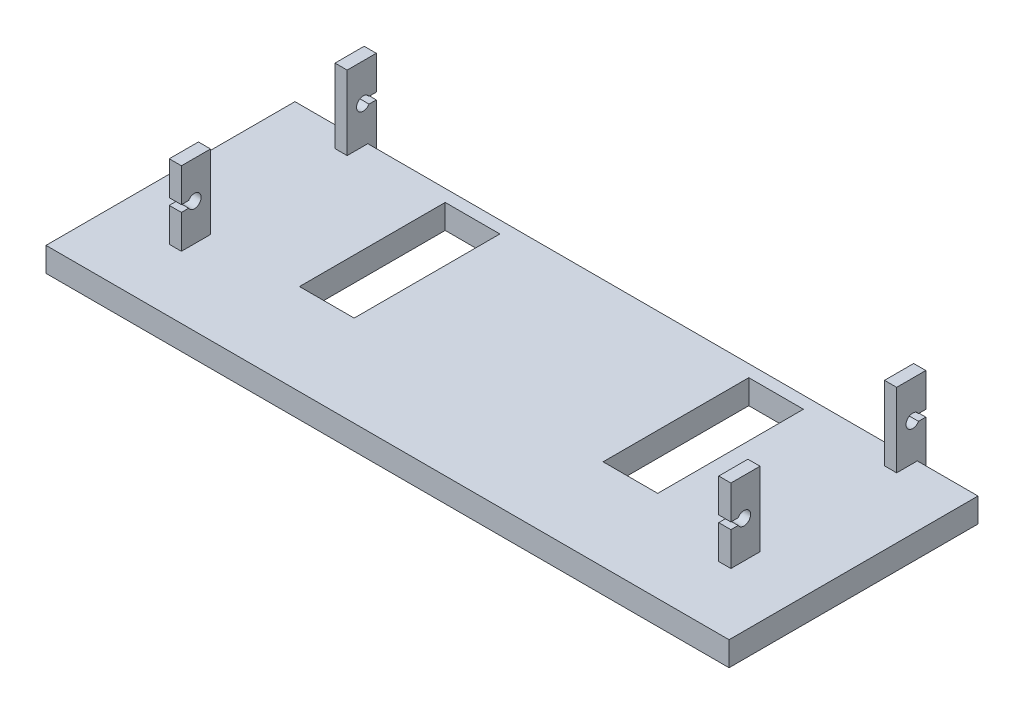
from build123d import *

# Parameters (mm, degrees)
SKETCH1_W            = 112.5
SKETCH1_H            = 41
BOSS_EXTRUDE1_DEPTH  = 4
SKETCH2_W            = 9
SKETCH2_H            = 11
CUT_EXTRUDE2_DEPTH   = 120.805049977
CUT_EXTRUDE4_DEPTH   = 9
CUT_EXTRUDE7_DEPTH   = 9
SKETCH17_W           = 2
SKETCH17_H           = 4
BOSS_EXTRUDE2_DEPTH  = 1.4
SKETCH16_W           = 2
SKETCH16_H           = 4.8
BOSS_EXTRUDE3_DEPTH  = 12.2
CUT_EXTRUDE8_DEPTH   = 100.5
SKETCH19_W           = 2
SKETCH19_H           = 4.8
BOSS_EXTRUDE4_DEPTH  = 12.2
MIRROR2_COPY_1_DEPTH = 100.5
SKETCH20_W           = 9
SKETCH20_H           = 13
CUT_EXTRUDE9_DEPTH   = 121.358173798


with BuildPart() as part:
    # Sketch1 → Boss-Extrude1 (new body)
    with BuildSketch(Plane(origin=(0, 0, 0), x_dir=(1, 0, 0), z_dir=(0, 1, 0))):
        with Locations((56.25, -20.5)):
            Rectangle(SKETCH1_W, SKETCH1_H)
    extrude(amount=BOSS_EXTRUDE1_DEPTH)

    # Sketch2 → Cut-Extrude2 (cut, through all)
    with BuildSketch(Plane(origin=(0, 0, 0), x_dir=(1, 0, 0), z_dir=(0, 1, 0))):
        with Locations((31.25, -20.5)):
            Rectangle(SKETCH2_W, SKETCH2_H)
        with Locations((81.25, -20.5)):
            Rectangle(SKETCH2_W, SKETCH2_H)
    extrude(amount=CUT_EXTRUDE2_DEPTH, mode=Mode.SUBTRACT)

    # Sketch9 → Cut-Extrude4 (cut)
    with BuildSketch(Plane(origin=(76.75, 0, 0), x_dir=(0, 0, -1), z_dir=(1, 0, 0))):
        Polygon((-37, 1.295779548), (-36.630569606, 0), (-31.431330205, 0), (-32.191604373, 2.666666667), align=None)
    extrude(amount=CUT_EXTRUDE4_DEPTH, mode=Mode.SUBTRACT)

    # Sketch14 → Cut-Extrude7 (cut)
    with BuildSketch(Plane(origin=(26.75, 0, 0), x_dir=(0, 0, -1), z_dir=(1, 0, 0))):
        Polygon((-37, 1.295779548), (-36.630569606, 0), (-31.431330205, 0), (-32.191604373, 2.666666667), align=None)
    extrude(amount=CUT_EXTRUDE7_DEPTH, mode=Mode.SUBTRACT)

    # Sketch17 → Boss-Extrude2 (add)
    with BuildSketch(Plane(origin=(0, 0, 0), x_dir=(-1, 0, 0), z_dir=(0, 0, -1))):
        with Locations((-11, 2)):
            Rectangle(SKETCH17_W, SKETCH17_H)
    boss_extrude2 = extrude(amount=BOSS_EXTRUDE2_DEPTH)

    # Sketch16 → Boss-Extrude3 (add)
    with BuildSketch(Plane(origin=(0, 4, 0), x_dir=(1, 0, 0), z_dir=(0, 1, 0))):
        with Locations((11, -1)):
            Rectangle(SKETCH16_W, SKETCH16_H)
    boss_extrude3 = extrude(amount=BOSS_EXTRUDE3_DEPTH)

    # Sketch18 → Cut-Extrude8 (cut)
    with BuildSketch(Plane.ZY):
        with BuildLine():
            ThreePointArc((1.85, 10.1), (1.03470095, 11.162518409), (-0.202627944, 10.65))
            Line((-0.202627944, 10.65), (0.75, 10.65))
            Line((0.75, 10.65), (0.75, 9.55))
            Line((0.75, 9.55), (-0.202627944, 9.55))
            ThreePointArc((-0.202627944, 9.55), (1.03470095, 9.037481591), (1.85, 10.1))
        make_face()
        with BuildLine():
            Line((0.75, 10.65), (-0.202627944, 10.65))
            ThreePointArc((-0.202627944, 10.65), (-0.35, 10.1), (-0.202627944, 9.55))
            Line((-0.202627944, 9.55), (0.75, 9.55))
            Line((0.75, 9.55), (0.75, 10.65))
        make_face()
        with BuildLine():
            ThreePointArc((1.85, 10.1), (1.03470095, 11.162518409), (-0.202627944, 10.65))
            Line((-0.202627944, 10.65), (0.75, 10.65))
            Line((0.75, 10.65), (0.75, 9.55))
            Line((0.75, 9.55), (-0.202627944, 9.55))
            ThreePointArc((-0.202627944, 9.55), (1.03470095, 9.037481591), (1.85, 10.1))
        make_face()
        with BuildLine():
            Line((0.75, 10.65), (-0.202627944, 10.65))
            ThreePointArc((-0.202627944, 10.65), (-0.35, 10.1), (-0.202627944, 9.55))
            Line((-0.202627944, 9.55), (0.75, 9.55))
            Line((0.75, 9.55), (0.75, 10.65))
        make_face()
        with BuildLine():
            Line((-0.202627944, 10.65), (-1.4, 10.65))
            Line((-1.4, 10.65), (-1.4, 9.55))
            Line((-1.4, 9.55), (-0.202627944, 9.55))
            ThreePointArc((-0.202627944, 9.55), (-0.35, 10.1), (-0.202627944, 10.65))
        make_face()
    cut_extrude8 = extrude(amount=-CUT_EXTRUDE8_DEPTH, mode=Mode.SUBTRACT)

    # Sketch19 → Boss-Extrude4 (add)
    with BuildSketch(Plane(origin=(0, 4, 0), x_dir=(1, 0, 0), z_dir=(0, 1, 0))):
        with Locations((11, -28.3)):
            Rectangle(SKETCH19_W, SKETCH19_H)
    boss_extrude4 = extrude(amount=BOSS_EXTRUDE4_DEPTH)

    # Mirror1: Cut-Extrude8 across plane
    add(cut_extrude8.mirror(Plane.XY.offset(14.65)), mode=Mode.SUBTRACT)

    # Mirror2: Boss-Extrude2, Boss-Extrude3, Cut-Extrude8, Boss-Extrude4 across plane
    add(boss_extrude2.mirror(Plane(origin=(56.25, 0, 0), x_dir=(0, 0, 1), z_dir=(1, 0, 0))))
    add(boss_extrude3.mirror(Plane(origin=(56.25, 0, 0), x_dir=(0, 0, 1), z_dir=(1, 0, 0))))
    add(cut_extrude8.mirror(Plane(origin=(56.25, 0, 0), x_dir=(0, 0, 1), z_dir=(1, 0, 0))), mode=Mode.SUBTRACT)
    add(boss_extrude4.mirror(Plane(origin=(56.25, 0, 0), x_dir=(0, 0, 1), z_dir=(1, 0, 0))))

    # Mirror2 copy 1 sketch → Mirror2 copy 1 (cut)
    with BuildSketch(Plane(origin=(112.5, 0, 29.3), x_dir=(0, 0, -1), z_dir=(1, 0, 0))):
        with BuildLine():
            ThreePointArc((1.85, 10.1), (1.03470095, 11.162518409), (-0.202627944, 10.65))
            Line((-0.202627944, 10.65), (0.75, 10.65))
            Line((0.75, 10.65), (0.75, 9.55))
            Line((0.75, 9.55), (-0.202627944, 9.55))
            ThreePointArc((-0.202627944, 9.55), (1.03470095, 9.037481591), (1.85, 10.1))
        make_face()
        with BuildLine():
            Line((0.75, 10.65), (-0.202627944, 10.65))
            ThreePointArc((-0.202627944, 10.65), (-0.35, 10.1), (-0.202627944, 9.55))
            Line((-0.202627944, 9.55), (0.75, 9.55))
            Line((0.75, 9.55), (0.75, 10.65))
        make_face()
        with BuildLine():
            ThreePointArc((1.85, 10.1), (1.03470095, 11.162518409), (-0.202627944, 10.65))
            Line((-0.202627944, 10.65), (0.75, 10.65))
            Line((0.75, 10.65), (0.75, 9.55))
            Line((0.75, 9.55), (-0.202627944, 9.55))
            ThreePointArc((-0.202627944, 9.55), (1.03470095, 9.037481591), (1.85, 10.1))
        make_face()
        with BuildLine():
            Line((0.75, 10.65), (-0.202627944, 10.65))
            ThreePointArc((-0.202627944, 10.65), (-0.35, 10.1), (-0.202627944, 9.55))
            Line((-0.202627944, 9.55), (0.75, 9.55))
            Line((0.75, 9.55), (0.75, 10.65))
        make_face()
        with BuildLine():
            Line((-0.202627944, 10.65), (-1.4, 10.65))
            Line((-1.4, 10.65), (-1.4, 9.55))
            Line((-1.4, 9.55), (-0.202627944, 9.55))
            ThreePointArc((-0.202627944, 9.55), (-0.35, 10.1), (-0.202627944, 10.65))
        make_face()
    extrude(amount=-MIRROR2_COPY_1_DEPTH, mode=Mode.SUBTRACT)

    # Sketch20 → Cut-Extrude9 (cut, through all)
    with BuildSketch(Plane(origin=(0, 4, 0), x_dir=(1, 0, 0), z_dir=(0, 1, 0))):
        with Locations((31.25, -8.5)):
            Rectangle(SKETCH20_W, SKETCH20_H)
        with Locations((81.25, -8.5)):
            Rectangle(SKETCH20_W, SKETCH20_H)
    extrude(amount=-CUT_EXTRUDE9_DEPTH, mode=Mode.SUBTRACT)


solid = part.part
